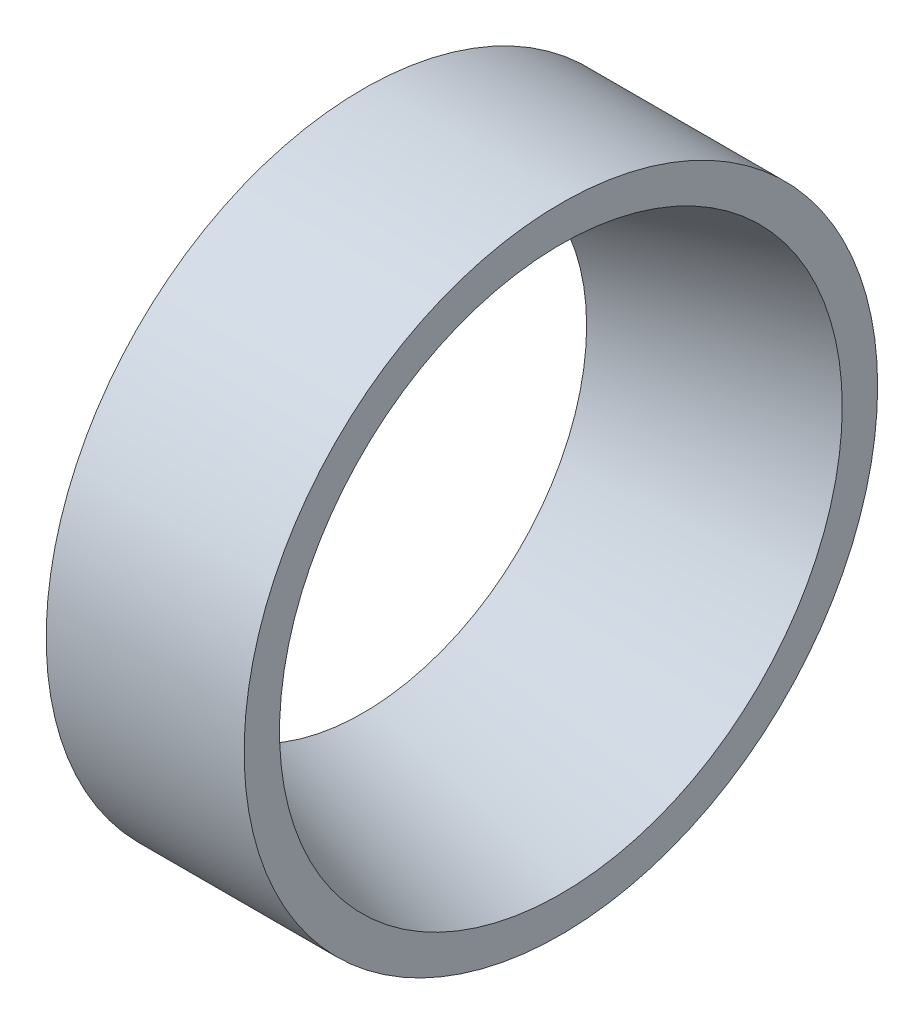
ISO-10303-21;
HEADER;
FILE_DESCRIPTION(('STEP AP214'),'2;1');
FILE_NAME('part.step','',(''),(''),'','','');
FILE_SCHEMA(('AUTOMOTIVE_DESIGN { 1 0 10303 214 1 1 1 1 }'));
ENDSEC;
DATA;
#1=APPLICATION_CONTEXT('core data for automotive mechanical design processes');
#2=APPLICATION_PROTOCOL_DEFINITION('international standard','automotive_design',2000,#1);
#3=PRODUCT_CONTEXT('',#1,'mechanical');
#4=PRODUCT('Part','Part','',(#3));
#5=PRODUCT_RELATED_PRODUCT_CATEGORY('part','',(#4));
#6=PRODUCT_DEFINITION_FORMATION('','',#4);
#7=PRODUCT_DEFINITION_CONTEXT('part definition',#1,'design');
#8=PRODUCT_DEFINITION('design','',#6,#7);
#9=PRODUCT_DEFINITION_SHAPE('','',#8);
#10=(LENGTH_UNIT() NAMED_UNIT(*) SI_UNIT(.MILLI.,.METRE.));
#11=(NAMED_UNIT(*) PLANE_ANGLE_UNIT() SI_UNIT($,.RADIAN.));
#12=(NAMED_UNIT(*) SI_UNIT($,.STERADIAN.) SOLID_ANGLE_UNIT());
#13=UNCERTAINTY_MEASURE_WITH_UNIT(LENGTH_MEASURE(1.E-05),#10,'distance_accuracy_value','');
#14=(GEOMETRIC_REPRESENTATION_CONTEXT(3) GLOBAL_UNCERTAINTY_ASSIGNED_CONTEXT((#13)) GLOBAL_UNIT_ASSIGNED_CONTEXT((#10,
#11,#12)) REPRESENTATION_CONTEXT('',''));
#15=CARTESIAN_POINT('',(0.,0.,0.));
#16=DIRECTION('',(0.,0.,1.));
#17=DIRECTION('',(1.,0.,0.));
#18=AXIS2_PLACEMENT_3D('',#15,#16,#17);
#19=CARTESIAN_POINT('',(-10.,0.,0.));
#20=DIRECTION('',(1.,0.,0.));
#21=DIRECTION('',(0.,0.,-1.));
#22=AXIS2_PLACEMENT_3D('',#19,#20,#21);
#23=CONICAL_SURFACE('',#22,11.3,0.283363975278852);
#24=CARTESIAN_POINT('',(0.,0.,0.));
#25=DIRECTION('',(1.,0.,0.));
#26=DIRECTION('',(0.,0.,-1.));
#27=AXIS2_PLACEMENT_3D('',#24,#25,#26);
#28=CIRCLE('',#27,14.212);
#29=CARTESIAN_POINT('',(0.,0.,-14.212));
#30=VERTEX_POINT('',#29);
#31=EDGE_CURVE('E36',#30,#30,#28,.T.);
#32=ORIENTED_EDGE('',*,*,#31,.T.);
#33=EDGE_LOOP('',(#32));
#34=FACE_BOUND('',#33,.T.);
#35=CARTESIAN_POINT('',(-10.,0.,0.));
#36=DIRECTION('',(1.,0.,0.));
#37=DIRECTION('',(0.,0.,-1.));
#38=AXIS2_PLACEMENT_3D('',#35,#36,#37);
#39=CIRCLE('',#38,11.3);
#40=CARTESIAN_POINT('',(-10.,0.,-11.3));
#41=VERTEX_POINT('',#40);
#42=EDGE_CURVE('E10',#41,#41,#39,.T.);
#43=ORIENTED_EDGE('',*,*,#42,.F.);
#44=EDGE_LOOP('',(#43));
#45=FACE_BOUND('',#44,.T.);
#46=ADVANCED_FACE('F22',(#34,#45),#23,.F.);
#47=CARTESIAN_POINT('',(-10.,16.,0.));
#48=DIRECTION('',(-1.,0.,0.));
#49=DIRECTION('',(0.,0.,1.));
#50=AXIS2_PLACEMENT_3D('',#47,#48,#49);
#51=PLANE('',#50);
#52=ORIENTED_EDGE('',*,*,#42,.T.);
#53=EDGE_LOOP('',(#52));
#54=FACE_BOUND('',#53,.T.);
#55=CARTESIAN_POINT('',(-10.,0.,0.));
#56=DIRECTION('',(1.,0.,0.));
#57=DIRECTION('',(0.,0.,-1.));
#58=AXIS2_PLACEMENT_3D('',#55,#56,#57);
#59=CIRCLE('',#58,16.);
#60=CARTESIAN_POINT('',(-10.,0.,-16.));
#61=VERTEX_POINT('',#60);
#62=EDGE_CURVE('E28',#61,#61,#59,.T.);
#63=ORIENTED_EDGE('',*,*,#62,.F.);
#64=EDGE_LOOP('',(#63));
#65=FACE_BOUND('',#64,.T.);
#66=ADVANCED_FACE('F52',(#54,#65),#51,.T.);
#67=CARTESIAN_POINT('',(40.,0.,0.));
#68=DIRECTION('',(1.,0.,0.));
#69=DIRECTION('',(0.,0.,-1.));
#70=AXIS2_PLACEMENT_3D('',#67,#68,#69);
#71=CYLINDRICAL_SURFACE('',#70,16.);
#72=ORIENTED_EDGE('',*,*,#62,.T.);
#73=EDGE_LOOP('',(#72));
#74=FACE_BOUND('',#73,.T.);
#75=CARTESIAN_POINT('',(0.,0.,0.));
#76=DIRECTION('',(1.,0.,0.));
#77=DIRECTION('',(0.,0.,-1.));
#78=AXIS2_PLACEMENT_3D('',#75,#76,#77);
#79=CIRCLE('',#78,16.);
#80=CARTESIAN_POINT('',(0.,0.,-16.));
#81=VERTEX_POINT('',#80);
#82=EDGE_CURVE('E32',#81,#81,#79,.T.);
#83=ORIENTED_EDGE('',*,*,#82,.F.);
#84=EDGE_LOOP('',(#83));
#85=FACE_BOUND('',#84,.T.);
#86=ADVANCED_FACE('F46',(#74,#85),#71,.T.);
#87=CARTESIAN_POINT('',(0.,14.212,0.));
#88=DIRECTION('',(1.,0.,0.));
#89=DIRECTION('',(0.,0.,-1.));
#90=AXIS2_PLACEMENT_3D('',#87,#88,#89);
#91=PLANE('',#90);
#92=ORIENTED_EDGE('',*,*,#82,.T.);
#93=EDGE_LOOP('',(#92));
#94=FACE_BOUND('',#93,.T.);
#95=ORIENTED_EDGE('',*,*,#31,.F.);
#96=EDGE_LOOP('',(#95));
#97=FACE_BOUND('',#96,.T.);
#98=ADVANCED_FACE('F44',(#94,#97),#91,.T.);
#99=CLOSED_SHELL('',(#46,#66,#86,#98));
#100=MANIFOLD_SOLID_BREP('B2',#99);
#101=ADVANCED_BREP_SHAPE_REPRESENTATION('',(#18,#100),#14);
#102=SHAPE_DEFINITION_REPRESENTATION(#9,#101);
ENDSEC;
END-ISO-10303-21;
